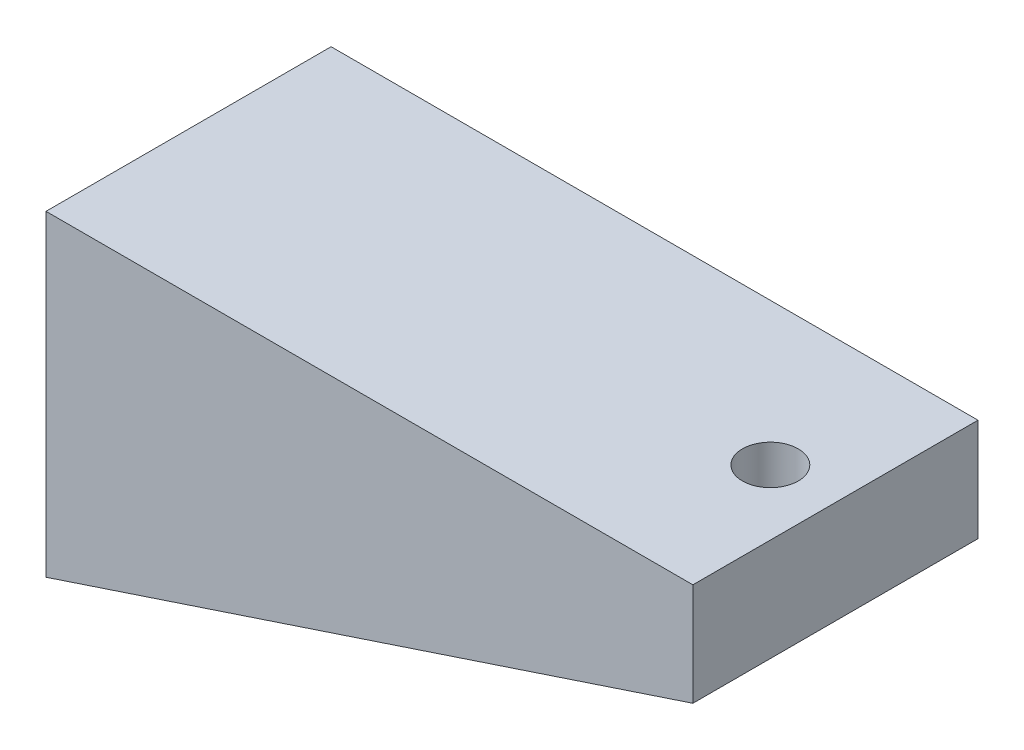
from build123d import *

# Parameters (mm, degrees)
EXTRUDE1_DEPTH     = 26.5
CUT_EXTRUDE1_REACH = 138.502
SKETCH2_R          = 5.187064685


with BuildPart() as part:
    # Sketch1 → Extrude1 (new, symmetric)
    with BuildSketch(Plane.XY):
        Polygon((0, 0), (120.250468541, 39.834136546), (120.250468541, 58.909638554), (0, 58.909638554), align=None)
    extrude(amount=EXTRUDE1_DEPTH, both=True)

    # Cut-Extrude1: up to this plane
    cut_extrude1_end = Plane(origin=(-1.572278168, 4.746360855, 26.5), z_dir=(-0.3144556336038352, 0.9492721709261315, 0))
    # Sketch2 → Cut-Extrude1 (cut, up to the surface)
    with BuildSketch(Plane(origin=(0, 58.909638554, 0), x_dir=(-1, 0, 0), z_dir=(0, 1, 0)), mode=Mode.PRIVATE) as cut_extrude1_sk1:
        with Locations((-108.150298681, 0)):
            Circle(SKETCH2_R)
    cut_extrude1_tool1 = split(extrude(cut_extrude1_sk1.sketch, amount=-CUT_EXTRUDE1_REACH, mode=Mode.PRIVATE), bisect_by=cut_extrude1_end, keep=Keep.BOTH, mode=Mode.PRIVATE)
    add(cut_extrude1_tool1.solids().sort_by_distance((108.150299, 58.909639, 0))[0], mode=Mode.SUBTRACT)


solid = part.part
